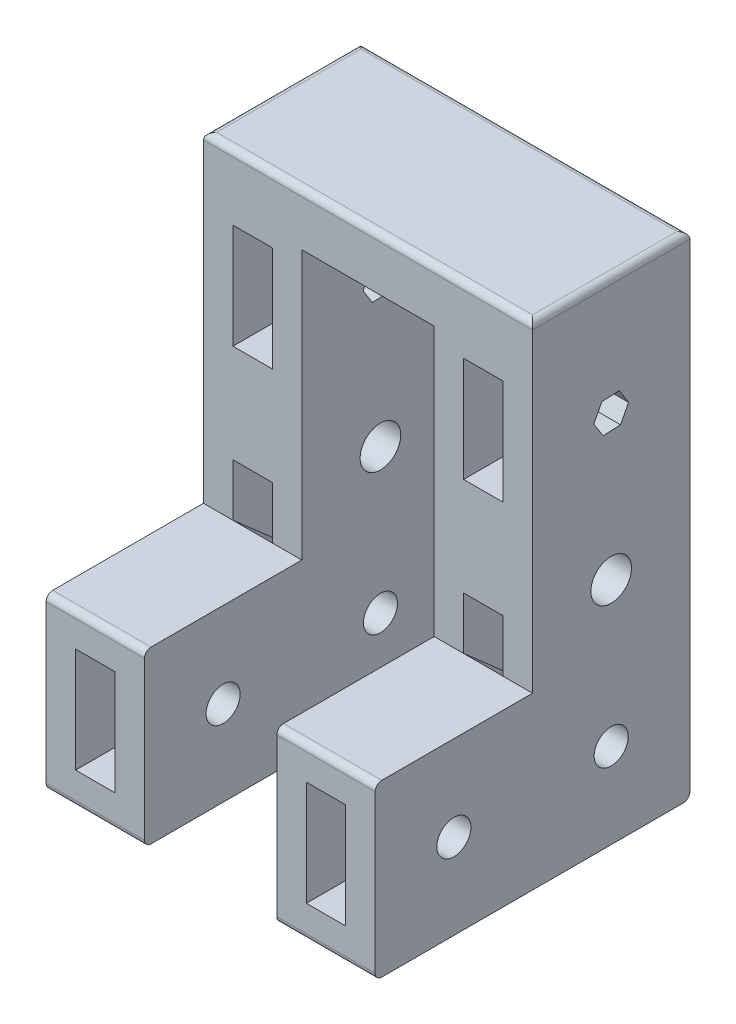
from build123d import *

# Parameters (mm, degrees)
EXTRUDE_1_DEPTH     = 25.1
SKETCH_2_R          = 2.6
SKETCH_2_R_2        = 3.1
CUT_EXTRUDE_1_DEPTH = 72.39287542
SKETCH_3_W          = 20.2
SKETCH_3_H          = 48
CUT_EXTRUDE_2_DEPTH = 67
SKETCH_4_W          = 6
SKETCH_4_H          = 16
CUT_EXTRUDE_3_DEPTH = 56.431174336
SKETCH_12_W         = 6
SKETCH_12_H         = 16
CUT_EXTRUDE_4_DEPTH = 70.286471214
FILLET_1_R          = 1


with BuildPart() as part:
    # Sketch 1 → Extrude 1 (new, symmetric)
    with BuildSketch(Plane.YZ):
        Polygon((-31.795774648, 21.348591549), (-31.795774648, -26.651408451), (43.204225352, -26.651408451), (43.204225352, -2.651408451), (-5.795774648, -2.651408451), (-5.795774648, 21.348591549), align=None)
    extrude(amount=EXTRUDE_1_DEPTH, both=True)

    # Sketch 2 → Cut-Extrude 1 (cut, through all)
    with BuildSketch(Plane.YZ.offset(25.1)):
        with Locations(Location((-18.795774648, 9.348591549, 0), (0, 0, 270))):
            Circle(SKETCH_2_R)
        with Locations(Location((-18.795774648, -14.651408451, 0), (0, 0, 270))):
            Circle(SKETCH_2_R)
        with Locations(Location((3.204225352, -14.651408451, 0), (0, 0, 270))):
            Circle(SKETCH_2_R_2)
        Polygon((27.558249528, -15.881003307), (27.446097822, -13.227561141), (25.092073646, -11.997966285), (22.850201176, -13.421813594), (22.962352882, -16.07525576), (25.316377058, -17.304850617), align=None)
    extrude(amount=-CUT_EXTRUDE_1_DEPTH, mode=Mode.SUBTRACT)

    # Sketch 3 → Cut-Extrude 2 (cut)
    with BuildSketch(Plane.XZ.offset(31.795774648)):
        with Locations((0, -2.651408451)):
            Rectangle(SKETCH_3_W, SKETCH_3_H)
    extrude(amount=-CUT_EXTRUDE_2_DEPTH, mode=Mode.SUBTRACT)

    # Sketch 4 → Cut-Extrude 3 (cut, through all)
    with BuildSketch(Plane.XY.offset(-2.651408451)):
        with Locations((-17.6, 25.204225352)):
            Rectangle(SKETCH_4_W, SKETCH_4_H)
        with Locations((17.6, 25.204225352)):
            Rectangle(SKETCH_4_W, SKETCH_4_H)
    extrude(amount=-CUT_EXTRUDE_3_DEPTH, mode=Mode.SUBTRACT)

    # Sketch 9 → Loft 1 section 0
    with BuildSketch(Plane.XY.offset(-2.651408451)):
        with BuildLine():
            Line((-20.6, -5.795774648), (-14.6, -5.795774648))
            Line((-14.6, -5.795774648), (-14.6, 2.204225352))
            Line((-14.6, 2.204225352), (-20.6, 2.204225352))
            Line((-20.6, 2.204225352), (-20.6, -5.795774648))
        make_face()
    # Sketch 8 → Loft 1 section 1
    with BuildSketch(Plane(origin=(0, 0, -26.651408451), x_dir=(1, 0, 0), z_dir=(0, 0, -1))):
        with BuildLine():
            Line((-20.6, 26.795774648), (-14.6, 26.795774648))
            Line((-14.6, 26.795774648), (-14.6, 10.795774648))
            Line((-14.6, 10.795774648), (-20.6, 10.795774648))
            Line((-20.6, 10.795774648), (-20.6, 26.795774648))
        make_face()
    loft(mode=Mode.SUBTRACT)

    # Sketch 11 → Loft 2 section 0
    with BuildSketch(Plane(origin=(0, 0, -26.651408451), x_dir=(1, 0, 0), z_dir=(0, 0, -1))):
        with BuildLine():
            Line((14.6, 26.795774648), (20.6, 26.795774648))
            Line((20.6, 26.795774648), (20.6, 10.795774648))
            Line((20.6, 10.795774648), (14.6, 10.795774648))
            Line((14.6, 10.795774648), (14.6, 26.795774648))
        make_face()
    # Sketch 10 → Loft 2 section 1
    with BuildSketch(Plane.XY.offset(-2.651408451)):
        with BuildLine():
            Line((14.6, -5.795774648), (20.6, -5.795774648))
            Line((20.6, -5.795774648), (20.6, 2.204225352))
            Line((20.6, 2.204225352), (14.6, 2.204225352))
            Line((14.6, 2.204225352), (14.6, -5.795774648))
        make_face()
    loft(mode=Mode.SUBTRACT)

    # Sketch 12 → Cut-Extrude 4 (cut, through all)
    with BuildSketch(Plane(origin=(0, 0, -26.651408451), x_dir=(1, 0, 0), z_dir=(0, 0, -1))):
        with Locations((-17.6, 18.795774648)):
            Rectangle(SKETCH_12_W, SKETCH_12_H)
        with Locations((17.6, 18.795774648)):
            Rectangle(SKETCH_12_W, SKETCH_12_H)
    extrude(amount=-CUT_EXTRUDE_4_DEPTH, mode=Mode.SUBTRACT)

    # Fillet 1
    fillet_1_edges = [part.edges().sort_by_distance(p)[0] for p in [
        (17.6, -5.795774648, 21.348591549),
        (0, 43.204225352, -2.651408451),
        (0, 43.204225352, -26.651408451),
        (17.6, -31.795774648, -26.651408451),
        (17.6, -31.795774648, 21.348591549),
        (25.1, 43.204225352, -14.651408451),
        (-17.6, -5.795774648, 21.348591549),
        (-17.6, -31.795774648, -26.651408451),
        (-17.6, -31.795774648, 21.348591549),
        (-25.1, 43.204225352, -14.651408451),
    ]]
    fillet(fillet_1_edges, radius=FILLET_1_R)


solid = part.part
